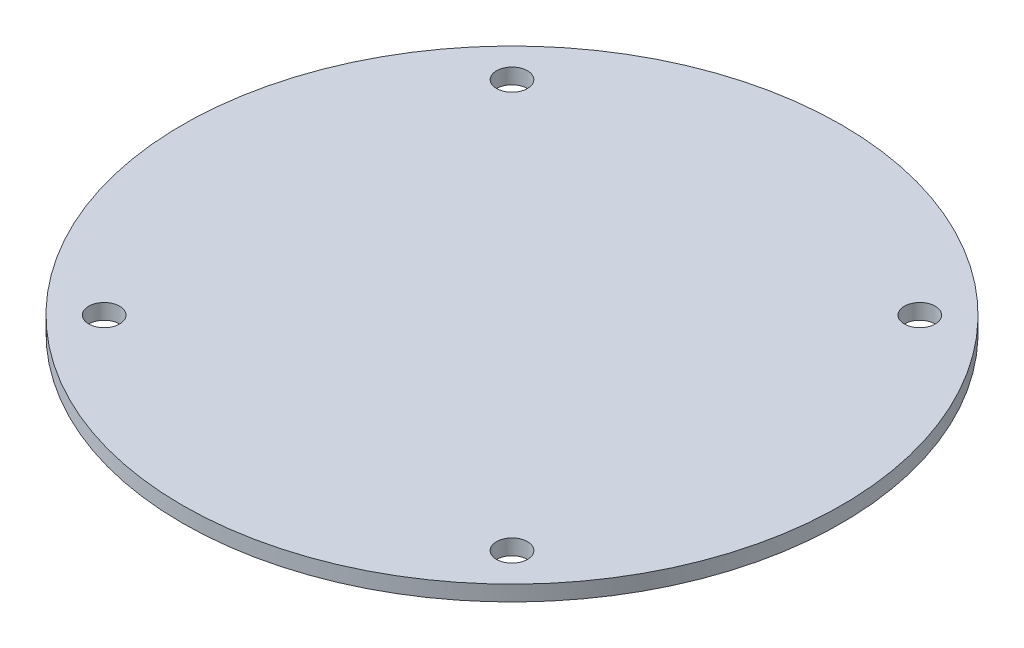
ISO-10303-21;
HEADER;
FILE_DESCRIPTION(('STEP AP214'),'2;1');
FILE_NAME('part.step','',(''),(''),'','','');
FILE_SCHEMA(('AUTOMOTIVE_DESIGN { 1 0 10303 214 1 1 1 1 }'));
ENDSEC;
DATA;
#1=APPLICATION_CONTEXT('core data for automotive mechanical design processes');
#2=APPLICATION_PROTOCOL_DEFINITION('international standard','automotive_design',2000,#1);
#3=PRODUCT_CONTEXT('',#1,'mechanical');
#4=PRODUCT('Part','Part','',(#3));
#5=PRODUCT_RELATED_PRODUCT_CATEGORY('part','',(#4));
#6=PRODUCT_DEFINITION_FORMATION('','',#4);
#7=PRODUCT_DEFINITION_CONTEXT('part definition',#1,'design');
#8=PRODUCT_DEFINITION('design','',#6,#7);
#9=PRODUCT_DEFINITION_SHAPE('','',#8);
#10=(LENGTH_UNIT() NAMED_UNIT(*) SI_UNIT(.MILLI.,.METRE.));
#11=(NAMED_UNIT(*) PLANE_ANGLE_UNIT() SI_UNIT($,.RADIAN.));
#12=(NAMED_UNIT(*) SI_UNIT($,.STERADIAN.) SOLID_ANGLE_UNIT());
#13=UNCERTAINTY_MEASURE_WITH_UNIT(LENGTH_MEASURE(1.E-05),#10,'distance_accuracy_value','');
#14=(GEOMETRIC_REPRESENTATION_CONTEXT(3) GLOBAL_UNCERTAINTY_ASSIGNED_CONTEXT((#13)) GLOBAL_UNIT_ASSIGNED_CONTEXT((#10,
#11,#12)) REPRESENTATION_CONTEXT('',''));
#15=CARTESIAN_POINT('',(0.,0.,0.));
#16=DIRECTION('',(0.,0.,1.));
#17=DIRECTION('',(1.,0.,0.));
#18=AXIS2_PLACEMENT_3D('',#15,#16,#17);
#19=CARTESIAN_POINT('',(0.,-1.5,0.));
#20=DIRECTION('',(0.,1.,0.));
#21=DIRECTION('',(0.,0.,1.));
#22=AXIS2_PLACEMENT_3D('',#19,#20,#21);
#23=CYLINDRICAL_SURFACE('',#22,32.);
#24=CARTESIAN_POINT('',(0.,-1.5,0.));
#25=DIRECTION('',(0.,1.,0.));
#26=DIRECTION('',(0.,0.,1.));
#27=AXIS2_PLACEMENT_3D('',#24,#25,#26);
#28=CIRCLE('',#27,32.);
#29=CARTESIAN_POINT('',(0.,-1.5,32.));
#30=VERTEX_POINT('',#29);
#31=EDGE_CURVE('E10',#30,#30,#28,.T.);
#32=ORIENTED_EDGE('',*,*,#31,.T.);
#33=EDGE_LOOP('',(#32));
#34=FACE_BOUND('',#33,.T.);
#35=CARTESIAN_POINT('',(0.,0.,0.));
#36=DIRECTION('',(0.,1.,0.));
#37=DIRECTION('',(0.,0.,1.));
#38=AXIS2_PLACEMENT_3D('',#35,#36,#37);
#39=CIRCLE('',#38,32.);
#40=CARTESIAN_POINT('',(0.,0.,32.));
#41=VERTEX_POINT('',#40);
#42=EDGE_CURVE('E44',#41,#41,#39,.T.);
#43=ORIENTED_EDGE('',*,*,#42,.F.);
#44=EDGE_LOOP('',(#43));
#45=FACE_BOUND('',#44,.T.);
#46=ADVANCED_FACE('F41',(#34,#45),#23,.T.);
#47=CARTESIAN_POINT('',(0.,-1.5,0.));
#48=DIRECTION('',(0.,1.,0.));
#49=DIRECTION('',(0.,0.,1.));
#50=AXIS2_PLACEMENT_3D('',#47,#48,#49);
#51=PLANE('',#50);
#52=CARTESIAN_POINT('',(-19.7989898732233,-1.5,19.7989898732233));
#53=DIRECTION('',(0.,1.,0.));
#54=DIRECTION('',(0.,0.,1.));
#55=AXIS2_PLACEMENT_3D('',#52,#53,#54);
#56=CIRCLE('',#55,1.5);
#57=CARTESIAN_POINT('',(-19.7989898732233,-1.5,21.2989898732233));
#58=VERTEX_POINT('',#57);
#59=EDGE_CURVE('E59',#58,#58,#56,.T.);
#60=ORIENTED_EDGE('',*,*,#59,.T.);
#61=EDGE_LOOP('',(#60));
#62=FACE_BOUND('',#61,.T.);
#63=CARTESIAN_POINT('',(19.7989898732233,-1.5,19.7989898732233));
#64=DIRECTION('',(0.,1.,0.));
#65=DIRECTION('',(0.,0.,1.));
#66=AXIS2_PLACEMENT_3D('',#63,#64,#65);
#67=CIRCLE('',#66,1.5);
#68=CARTESIAN_POINT('',(19.7989898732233,-1.5,21.2989898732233));
#69=VERTEX_POINT('',#68);
#70=EDGE_CURVE('E65',#69,#69,#67,.T.);
#71=ORIENTED_EDGE('',*,*,#70,.T.);
#72=EDGE_LOOP('',(#71));
#73=FACE_BOUND('',#72,.T.);
#74=CARTESIAN_POINT('',(19.7989898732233,-1.5,-19.7989898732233));
#75=DIRECTION('',(0.,1.,0.));
#76=DIRECTION('',(0.,0.,1.));
#77=AXIS2_PLACEMENT_3D('',#74,#75,#76);
#78=CIRCLE('',#77,1.5);
#79=CARTESIAN_POINT('',(19.7989898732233,-1.5,-18.2989898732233));
#80=VERTEX_POINT('',#79);
#81=EDGE_CURVE('E71',#80,#80,#78,.T.);
#82=ORIENTED_EDGE('',*,*,#81,.T.);
#83=EDGE_LOOP('',(#82));
#84=FACE_BOUND('',#83,.T.);
#85=CARTESIAN_POINT('',(-19.7989898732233,-1.5,-19.7989898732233));
#86=DIRECTION('',(0.,1.,0.));
#87=DIRECTION('',(0.,0.,1.));
#88=AXIS2_PLACEMENT_3D('',#85,#86,#87);
#89=CIRCLE('',#88,1.5);
#90=CARTESIAN_POINT('',(-19.7989898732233,-1.5,-18.2989898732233));
#91=VERTEX_POINT('',#90);
#92=EDGE_CURVE('E51',#91,#91,#89,.T.);
#93=ORIENTED_EDGE('',*,*,#92,.T.);
#94=EDGE_LOOP('',(#93));
#95=FACE_BOUND('',#94,.T.);
#96=ORIENTED_EDGE('',*,*,#31,.F.);
#97=EDGE_LOOP('',(#96));
#98=FACE_BOUND('',#97,.T.);
#99=ADVANCED_FACE('F83',(#62,#73,#84,#95,#98),#51,.F.);
#100=CARTESIAN_POINT('',(0.,0.,0.));
#101=DIRECTION('',(0.,1.,0.));
#102=DIRECTION('',(0.,0.,1.));
#103=AXIS2_PLACEMENT_3D('',#100,#101,#102);
#104=PLANE('',#103);
#105=CARTESIAN_POINT('',(-19.7989898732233,0.,19.7989898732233));
#106=DIRECTION('',(0.,1.,0.));
#107=DIRECTION('',(0.,0.,1.));
#108=AXIS2_PLACEMENT_3D('',#105,#106,#107);
#109=CIRCLE('',#108,1.5);
#110=CARTESIAN_POINT('',(-19.7989898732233,0.,21.2989898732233));
#111=VERTEX_POINT('',#110);
#112=EDGE_CURVE('E62',#111,#111,#109,.T.);
#113=ORIENTED_EDGE('',*,*,#112,.F.);
#114=EDGE_LOOP('',(#113));
#115=FACE_BOUND('',#114,.T.);
#116=CARTESIAN_POINT('',(19.7989898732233,0.,19.7989898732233));
#117=DIRECTION('',(0.,1.,0.));
#118=DIRECTION('',(0.,0.,1.));
#119=AXIS2_PLACEMENT_3D('',#116,#117,#118);
#120=CIRCLE('',#119,1.5);
#121=CARTESIAN_POINT('',(19.7989898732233,0.,21.2989898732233));
#122=VERTEX_POINT('',#121);
#123=EDGE_CURVE('E68',#122,#122,#120,.T.);
#124=ORIENTED_EDGE('',*,*,#123,.F.);
#125=EDGE_LOOP('',(#124));
#126=FACE_BOUND('',#125,.T.);
#127=CARTESIAN_POINT('',(19.7989898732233,0.,-19.7989898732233));
#128=DIRECTION('',(0.,1.,0.));
#129=DIRECTION('',(0.,0.,1.));
#130=AXIS2_PLACEMENT_3D('',#127,#128,#129);
#131=CIRCLE('',#130,1.5);
#132=CARTESIAN_POINT('',(19.7989898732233,0.,-18.2989898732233));
#133=VERTEX_POINT('',#132);
#134=EDGE_CURVE('E56',#133,#133,#131,.T.);
#135=ORIENTED_EDGE('',*,*,#134,.F.);
#136=EDGE_LOOP('',(#135));
#137=FACE_BOUND('',#136,.T.);
#138=CARTESIAN_POINT('',(-19.7989898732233,0.,-19.7989898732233));
#139=DIRECTION('',(0.,1.,0.));
#140=DIRECTION('',(0.,0.,1.));
#141=AXIS2_PLACEMENT_3D('',#138,#139,#140);
#142=CIRCLE('',#141,1.5);
#143=CARTESIAN_POINT('',(-19.7989898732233,0.,-18.2989898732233));
#144=VERTEX_POINT('',#143);
#145=EDGE_CURVE('E53',#144,#144,#142,.T.);
#146=ORIENTED_EDGE('',*,*,#145,.F.);
#147=EDGE_LOOP('',(#146));
#148=FACE_BOUND('',#147,.T.);
#149=ORIENTED_EDGE('',*,*,#42,.T.);
#150=EDGE_LOOP('',(#149));
#151=FACE_BOUND('',#150,.T.);
#152=ADVANCED_FACE('F79',(#115,#126,#137,#148,#151),#104,.T.);
#153=CARTESIAN_POINT('',(-19.7989898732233,-1.5,-19.7989898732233));
#154=DIRECTION('',(0.,1.,0.));
#155=DIRECTION('',(0.,0.,1.));
#156=AXIS2_PLACEMENT_3D('',#153,#154,#155);
#157=CYLINDRICAL_SURFACE('',#156,1.5);
#158=ORIENTED_EDGE('',*,*,#92,.F.);
#159=EDGE_LOOP('',(#158));
#160=FACE_BOUND('',#159,.T.);
#161=ORIENTED_EDGE('',*,*,#145,.T.);
#162=EDGE_LOOP('',(#161));
#163=FACE_BOUND('',#162,.T.);
#164=ADVANCED_FACE('F82',(#160,#163),#157,.F.);
#165=CARTESIAN_POINT('',(19.7989898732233,-1.5,-19.7989898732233));
#166=DIRECTION('',(0.,1.,0.));
#167=DIRECTION('',(0.,0.,1.));
#168=AXIS2_PLACEMENT_3D('',#165,#166,#167);
#169=CYLINDRICAL_SURFACE('',#168,1.5);
#170=ORIENTED_EDGE('',*,*,#81,.F.);
#171=EDGE_LOOP('',(#170));
#172=FACE_BOUND('',#171,.T.);
#173=ORIENTED_EDGE('',*,*,#134,.T.);
#174=EDGE_LOOP('',(#173));
#175=FACE_BOUND('',#174,.T.);
#176=ADVANCED_FACE('F77',(#172,#175),#169,.F.);
#177=CARTESIAN_POINT('',(19.7989898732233,-1.5,19.7989898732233));
#178=DIRECTION('',(0.,1.,0.));
#179=DIRECTION('',(0.,0.,1.));
#180=AXIS2_PLACEMENT_3D('',#177,#178,#179);
#181=CYLINDRICAL_SURFACE('',#180,1.5);
#182=ORIENTED_EDGE('',*,*,#70,.F.);
#183=EDGE_LOOP('',(#182));
#184=FACE_BOUND('',#183,.T.);
#185=ORIENTED_EDGE('',*,*,#123,.T.);
#186=EDGE_LOOP('',(#185));
#187=FACE_BOUND('',#186,.T.);
#188=ADVANCED_FACE('F105',(#184,#187),#181,.F.);
#189=CARTESIAN_POINT('',(-19.7989898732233,-1.5,19.7989898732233));
#190=DIRECTION('',(0.,1.,0.));
#191=DIRECTION('',(0.,0.,1.));
#192=AXIS2_PLACEMENT_3D('',#189,#190,#191);
#193=CYLINDRICAL_SURFACE('',#192,1.5);
#194=ORIENTED_EDGE('',*,*,#59,.F.);
#195=EDGE_LOOP('',(#194));
#196=FACE_BOUND('',#195,.T.);
#197=ORIENTED_EDGE('',*,*,#112,.T.);
#198=EDGE_LOOP('',(#197));
#199=FACE_BOUND('',#198,.T.);
#200=ADVANCED_FACE('F102',(#196,#199),#193,.F.);
#201=CLOSED_SHELL('',(#46,#99,#152,#164,#176,#188,#200));
#202=MANIFOLD_SOLID_BREP('B2',#201);
#203=ADVANCED_BREP_SHAPE_REPRESENTATION('',(#18,#202),#14);
#204=SHAPE_DEFINITION_REPRESENTATION(#9,#203);
ENDSEC;
END-ISO-10303-21;
